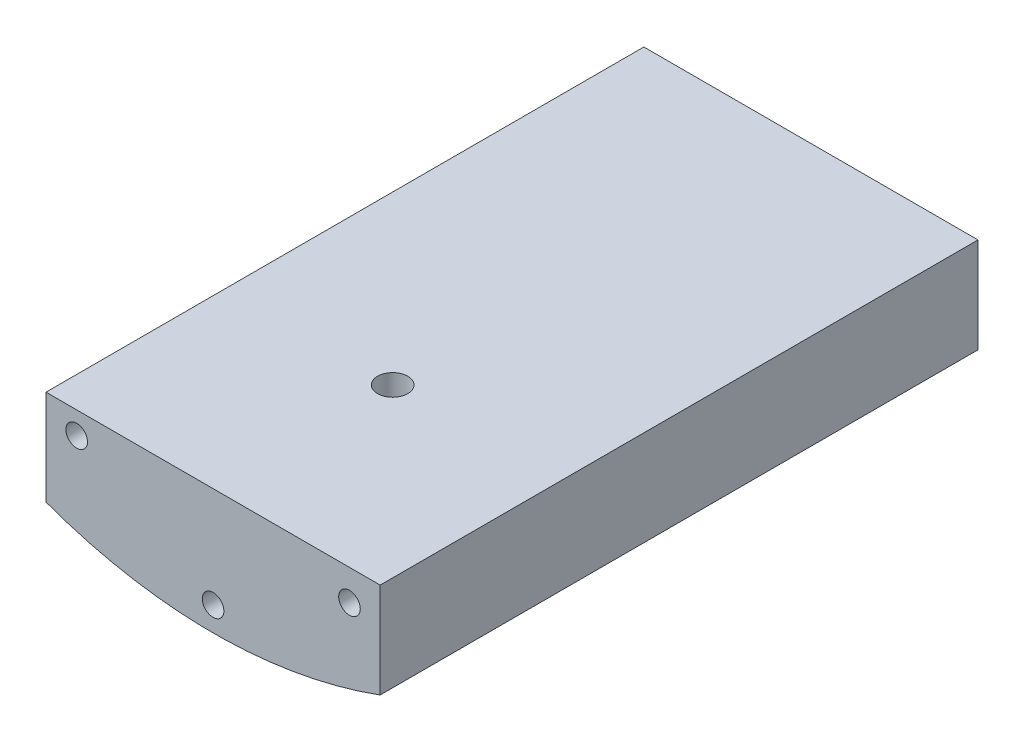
ISO-10303-21;
HEADER;
FILE_DESCRIPTION(('STEP AP214'),'2;1');
FILE_NAME('part.step','',(''),(''),'','','');
FILE_SCHEMA(('AUTOMOTIVE_DESIGN { 1 0 10303 214 1 1 1 1 }'));
ENDSEC;
DATA;
#1=APPLICATION_CONTEXT('core data for automotive mechanical design processes');
#2=APPLICATION_PROTOCOL_DEFINITION('international standard','automotive_design',2000,#1);
#3=PRODUCT_CONTEXT('',#1,'mechanical');
#4=PRODUCT('Part','Part','',(#3));
#5=PRODUCT_RELATED_PRODUCT_CATEGORY('part','',(#4));
#6=PRODUCT_DEFINITION_FORMATION('','',#4);
#7=PRODUCT_DEFINITION_CONTEXT('part definition',#1,'design');
#8=PRODUCT_DEFINITION('design','',#6,#7);
#9=PRODUCT_DEFINITION_SHAPE('','',#8);
#10=(LENGTH_UNIT() NAMED_UNIT(*) SI_UNIT(.MILLI.,.METRE.));
#11=(NAMED_UNIT(*) PLANE_ANGLE_UNIT() SI_UNIT($,.RADIAN.));
#12=(NAMED_UNIT(*) SI_UNIT($,.STERADIAN.) SOLID_ANGLE_UNIT());
#13=UNCERTAINTY_MEASURE_WITH_UNIT(LENGTH_MEASURE(1.E-05),#10,'distance_accuracy_value','');
#14=(GEOMETRIC_REPRESENTATION_CONTEXT(3) GLOBAL_UNCERTAINTY_ASSIGNED_CONTEXT((#13)) GLOBAL_UNIT_ASSIGNED_CONTEXT((#10,
#11,#12)) REPRESENTATION_CONTEXT('',''));
#15=CARTESIAN_POINT('',(0.,0.,0.));
#16=DIRECTION('',(0.,0.,1.));
#17=DIRECTION('',(1.,0.,0.));
#18=AXIS2_PLACEMENT_3D('',#15,#16,#17);
#19=CARTESIAN_POINT('',(3.3782,-23.495,93.472));
#20=DIRECTION('',(0.,1.,0.));
#21=DIRECTION('',(0.,0.,1.));
#22=AXIS2_PLACEMENT_3D('',#19,#20,#21);
#23=PLANE('',#22);
#24=CARTESIAN_POINT('',(0.,-23.495,93.472));
#25=DIRECTION('',(0.,-1.,0.));
#26=DIRECTION('',(0.,0.,-1.));
#27=AXIS2_PLACEMENT_3D('',#24,#25,#26);
#28=CIRCLE('',#27,6.74624);
#29=CARTESIAN_POINT('',(-2.20029103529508,-23.495,99.8493406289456));
#30=VERTEX_POINT('',#29);
#31=CARTESIAN_POINT('',(-2.20029103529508,-23.495,87.0946593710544));
#32=VERTEX_POINT('',#31);
#33=EDGE_CURVE('E138',#30,#32,#28,.T.);
#34=ORIENTED_EDGE('',*,*,#33,.T.);
#35=DIRECTION('',(0.,0.,1.));
#36=VECTOR('',#35,1.);
#37=CARTESIAN_POINT('',(-2.20029103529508,-23.495,133.604));
#38=LINE('',#37,#36);
#39=CARTESIAN_POINT('',(-2.20029103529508,-23.495,90.9086126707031));
#40=VERTEX_POINT('',#39);
#41=EDGE_CURVE('E124',#32,#40,#38,.T.);
#42=ORIENTED_EDGE('',*,*,#41,.T.);
#43=CARTESIAN_POINT('',(0.,-23.495,93.472));
#44=DIRECTION('',(0.,-1.,0.));
#45=DIRECTION('',(0.,0.,-1.));
#46=AXIS2_PLACEMENT_3D('',#43,#44,#45);
#47=CIRCLE('',#46,3.3782);
#48=CARTESIAN_POINT('',(-2.20029103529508,-23.495,96.0353873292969));
#49=VERTEX_POINT('',#48);
#50=EDGE_CURVE('E136',#49,#40,#47,.T.);
#51=ORIENTED_EDGE('',*,*,#50,.F.);
#52=EDGE_CURVE('E142',#49,#30,#38,.T.);
#53=ORIENTED_EDGE('',*,*,#52,.T.);
#54=EDGE_LOOP('',(#34,#42,#51,#53));
#55=FACE_BOUND('',#54,.T.);
#56=ADVANCED_FACE('F43',(#55),#23,.F.);
#57=CARTESIAN_POINT('',(0.,80.01,133.604));
#58=DIRECTION('',(0.,0.,-1.));
#59=DIRECTION('',(-1.,0.,0.));
#60=AXIS2_PLACEMENT_3D('',#57,#58,#59);
#61=CYLINDRICAL_SURFACE('',#60,107.95);
#62=CARTESIAN_POINT('',(0.,-27.94,86.72576));
#63=CARTESIAN_POINT('',(-0.189339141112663,-27.9400002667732,86.7257584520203));
#64=CARTESIAN_POINT('',(-0.37865360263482,-27.9395008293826,86.7337341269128));
#65=CARTESIAN_POINT('',(-0.755997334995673,-27.9375176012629,86.7655797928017));
#66=CARTESIAN_POINT('',(-0.944026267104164,-27.9360335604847,86.7894538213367));
#67=CARTESIAN_POINT('',(-1.31755641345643,-27.9321209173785,86.8529575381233));
#68=CARTESIAN_POINT('',(-1.50305532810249,-27.9296915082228,86.8926006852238));
#69=CARTESIAN_POINT('',(-1.87011315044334,-27.9239561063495,86.987374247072));
#70=CARTESIAN_POINT('',(-2.0516705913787,-27.9206497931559,87.0425103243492));
#71=CARTESIAN_POINT('',(-2.40932304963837,-27.9132580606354,87.1678117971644));
#72=CARTESIAN_POINT('',(-2.58542281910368,-27.9091733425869,87.2379636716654));
#73=CARTESIAN_POINT('',(-2.93114710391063,-27.9003368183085,87.392853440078));
#74=CARTESIAN_POINT('',(-3.10076920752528,-27.8955847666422,87.4775967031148));
#75=CARTESIAN_POINT('',(-3.43216973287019,-27.8855521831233,87.660992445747));
#76=CARTESIAN_POINT('',(-3.59395279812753,-27.8802719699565,87.7596365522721));
#77=CARTESIAN_POINT('',(-3.90870066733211,-27.8693278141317,87.9702113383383));
#78=CARTESIAN_POINT('',(-4.06166218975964,-27.8636637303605,88.0821469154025));
#79=CARTESIAN_POINT('',(-4.35776381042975,-27.8521081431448,88.3185954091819));
#80=CARTESIAN_POINT('',(-4.50089442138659,-27.8462164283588,88.4431201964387));
#81=CARTESIAN_POINT('',(-4.77621337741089,-27.834375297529,88.7038247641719));
#82=CARTESIAN_POINT('',(-4.90839766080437,-27.8284258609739,88.8400088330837));
#83=CARTESIAN_POINT('',(-5.16078789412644,-27.8166420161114,89.1229823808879));
#84=CARTESIAN_POINT('',(-5.28099774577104,-27.8108075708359,89.2697683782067));
#85=CARTESIAN_POINT('',(-5.50867853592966,-27.7994149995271,89.5730031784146));
#86=CARTESIAN_POINT('',(-5.61614475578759,-27.7938569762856,89.729455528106));
#87=CARTESIAN_POINT('',(-5.81756729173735,-27.7831750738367,90.0509388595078));
#88=CARTESIAN_POINT('',(-5.91151765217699,-27.7780513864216,90.2159735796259));
#89=CARTESIAN_POINT('',(-6.08521408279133,-27.7683848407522,90.5534459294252));
#90=CARTESIAN_POINT('',(-6.16495488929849,-27.7638421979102,90.7258862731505));
#91=CARTESIAN_POINT('',(-6.30959162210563,-27.7554713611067,91.0768389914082));
#92=CARTESIAN_POINT('',(-6.37449314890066,-27.7516428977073,91.2553490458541));
#93=CARTESIAN_POINT('',(-6.48904322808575,-27.7448052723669,91.6172324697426));
#94=CARTESIAN_POINT('',(-6.53868614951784,-27.7417964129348,91.8006076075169));
#95=CARTESIAN_POINT('',(-6.66396073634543,-27.7341484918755,92.3554619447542));
#96=CARTESIAN_POINT('',(-6.71628797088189,-27.7308671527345,92.7325210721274));
#97=CARTESIAN_POINT('',(-6.75688206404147,-27.7283283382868,93.489879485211));
#98=CARTESIAN_POINT('',(-6.74514964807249,-27.7290708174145,93.8701787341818));
#99=CARTESIAN_POINT('',(-6.65810898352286,-27.7344846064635,94.6229097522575));
#100=CARTESIAN_POINT('',(-6.58289005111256,-27.7391503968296,94.9953518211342));
#101=CARTESIAN_POINT('',(-6.37112787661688,-27.7518781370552,95.7222984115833));
#102=CARTESIAN_POINT('',(-6.23458426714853,-27.7599401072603,96.0768028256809));
#103=CARTESIAN_POINT('',(-5.90395323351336,-27.7785575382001,96.7581159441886));
#104=CARTESIAN_POINT('',(-5.70982528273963,-27.7891147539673,97.0849049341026));
#105=CARTESIAN_POINT('',(-5.2695639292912,-27.8115313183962,97.7012904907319));
#106=CARTESIAN_POINT('',(-5.023429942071,-27.8233906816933,97.9908866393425));
#107=CARTESIAN_POINT('',(-4.48564059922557,-27.8470995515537,98.5251870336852));
#108=CARTESIAN_POINT('',(-4.1939079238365,-27.8589490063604,98.7698134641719));
#109=CARTESIAN_POINT('',(-3.57347337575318,-27.8812831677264,99.206629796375));
#110=CARTESIAN_POINT('',(-3.24477149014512,-27.8917678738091,99.3988196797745));
#111=CARTESIAN_POINT('',(-2.55968200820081,-27.9101918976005,99.7253008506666));
#112=CARTESIAN_POINT('',(-2.20329300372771,-27.9181310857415,99.8595891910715));
#113=CARTESIAN_POINT('',(-1.47296694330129,-27.9305676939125,100.066403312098));
#114=CARTESIAN_POINT('',(-1.0990300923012,-27.9350651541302,100.13892981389));
#115=CARTESIAN_POINT('',(-0.344898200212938,-27.9401063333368,100.22006508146));
#116=CARTESIAN_POINT('',(0.0352852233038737,-27.9406567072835,100.228781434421));
#117=CARTESIAN_POINT('',(0.79171178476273,-27.9377593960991,100.182330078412));
#118=CARTESIAN_POINT('',(1.16795494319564,-27.9343117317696,100.127162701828));
#119=CARTESIAN_POINT('',(1.90551772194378,-27.9238107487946,99.9545989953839));
#120=CARTESIAN_POINT('',(2.26684893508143,-27.9167602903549,99.8372520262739));
#121=CARTESIAN_POINT('',(2.96468874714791,-27.899846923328,99.5437102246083));
#122=CARTESIAN_POINT('',(3.3011971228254,-27.8899839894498,99.3675148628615));
#123=CARTESIAN_POINT('',(3.94033173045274,-27.8685373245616,98.9610043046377));
#124=CARTESIAN_POINT('',(4.24291218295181,-27.8569513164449,98.7306172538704));
#125=CARTESIAN_POINT('',(4.80514079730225,-27.8333700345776,98.2223664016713));
#126=CARTESIAN_POINT('',(5.06478853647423,-27.8213747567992,97.9445021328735));
#127=CARTESIAN_POINT('',(5.53414624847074,-27.7983075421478,97.3487252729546));
#128=CARTESIAN_POINT('',(5.7437864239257,-27.7872369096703,97.0307576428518));
#129=CARTESIAN_POINT('',(6.10669864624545,-27.7672884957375,96.3640578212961));
#130=CARTESIAN_POINT('',(6.25997104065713,-27.7584107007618,96.0153258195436));
#131=CARTESIAN_POINT('',(6.50568345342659,-27.7438574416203,95.2973217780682));
#132=CARTESIAN_POINT('',(6.59816739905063,-27.7381796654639,94.928064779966));
#133=CARTESIAN_POINT('',(6.71979331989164,-27.7306644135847,94.1790207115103));
#134=CARTESIAN_POINT('',(6.74893592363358,-27.7288268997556,93.7992337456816));
#135=CARTESIAN_POINT('',(6.74459331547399,-27.7290956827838,93.2306300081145));
#136=CARTESIAN_POINT('',(6.73514704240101,-27.7296887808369,93.0413351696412));
#137=CARTESIAN_POINT('',(6.70037697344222,-27.7318572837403,92.6642339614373));
#138=CARTESIAN_POINT('',(6.67505905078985,-27.7334323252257,92.4764270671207));
#139=CARTESIAN_POINT('',(6.60870818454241,-27.7375223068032,92.1035626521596));
#140=CARTESIAN_POINT('',(6.56766943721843,-27.7400375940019,91.9185061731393));
#141=CARTESIAN_POINT('',(6.47019352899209,-27.7459347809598,91.552577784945));
#142=CARTESIAN_POINT('',(6.41376203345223,-27.7493163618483,91.3717043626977));
#143=CARTESIAN_POINT('',(6.28587392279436,-27.7568519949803,91.0152940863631));
#144=CARTESIAN_POINT('',(6.21441192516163,-27.7610063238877,90.8397591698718));
#145=CARTESIAN_POINT('',(6.05701436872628,-27.7699669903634,90.4953984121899));
#146=CARTESIAN_POINT('',(5.97108413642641,-27.7747730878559,90.3265701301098));
#147=CARTESIAN_POINT('',(5.78531112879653,-27.7849039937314,89.9966907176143));
#148=CARTESIAN_POINT('',(5.68546363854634,-27.7902289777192,89.8356422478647));
#149=CARTESIAN_POINT('',(5.47262574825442,-27.8012434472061,89.5225777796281));
#150=CARTESIAN_POINT('',(5.35964017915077,-27.806932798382,89.3705584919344));
#151=CARTESIAN_POINT('',(5.12106069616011,-27.8185283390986,89.0762698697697));
#152=CARTESIAN_POINT('',(4.99544241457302,-27.8244349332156,88.9340203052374));
#153=CARTESIAN_POINT('',(4.73272174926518,-27.8362847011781,88.6606568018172));
#154=CARTESIAN_POINT('',(4.59562360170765,-27.8422278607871,88.5295387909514));
#155=CARTESIAN_POINT('',(4.31078497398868,-27.8539882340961,88.2792304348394));
#156=CARTESIAN_POINT('',(4.16303801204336,-27.8598053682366,88.1600474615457));
#157=CARTESIAN_POINT('',(3.85807835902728,-27.8711429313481,87.9345881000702));
#158=CARTESIAN_POINT('',(3.70086917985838,-27.8766634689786,87.8283069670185));
#159=CARTESIAN_POINT('',(3.37778751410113,-27.8872622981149,87.6291950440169));
#160=CARTESIAN_POINT('',(3.21190149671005,-27.892339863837,87.5363861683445));
#161=CARTESIAN_POINT('',(2.87294103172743,-27.9018966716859,87.3651179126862));
#162=CARTESIAN_POINT('',(2.69986923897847,-27.9063761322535,87.2866532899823));
#163=CARTESIAN_POINT('',(2.34785890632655,-27.9146080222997,87.14465486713));
#164=CARTESIAN_POINT('',(2.1689255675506,-27.9183610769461,87.0811082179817));
#165=CARTESIAN_POINT('',(1.80638584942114,-27.9250376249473,86.9693307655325));
#166=CARTESIAN_POINT('',(1.62278067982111,-27.9279613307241,86.9210960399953));
#167=CARTESIAN_POINT('',(1.20159790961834,-27.9335696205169,86.8292478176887));
#168=CARTESIAN_POINT('',(0.962945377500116,-27.9359719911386,86.7904744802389));
#169=CARTESIAN_POINT('',(0.48284852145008,-27.9391870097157,86.7387315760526));
#170=CARTESIAN_POINT('',(0.241404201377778,-27.9399996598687,86.7257619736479));
#171=CARTESIAN_POINT('',(0.,-27.94,86.72576));
#172=B_SPLINE_CURVE_WITH_KNOTS('',3,(#62,#63,#64,#65,#66,#67,#68,#69,#70,#71,#72,#73,#74,#75,
#76,#77,#78,#79,#80,#81,#82,#83,#84,#85,#86,#87,#88,#89,#90,#91,#92,#93,#94,#95,#96,#97,#98,#99,
#100,#101,#102,#103,#104,#105,#106,#107,#108,#109,#110,#111,#112,#113,#114,#115,#116,#117,#118,
#119,#120,#121,#122,#123,#124,#125,#126,#127,#128,#129,#130,#131,#132,#133,#134,#135,#136,#137,
#138,#139,#140,#141,#142,#143,#144,#145,#146,#147,#148,#149,#150,#151,#152,#153,#154,#155,#156,
#157,#158,#159,#160,#161,#162,#163,#164,#165,#166,#167,#168,#169,#170,#171),.UNSPECIFIED.,.T.,
.F.,(4,2,2,2,2,2,2,2,2,2,2,2,2,2,2,2,2,2,2,2,2,2,2,2,2,2,2,2,2,2,2,2,2,2,2,2,2,2,2,2,2,2,2,2,2,
2,2,2,2,2,2,2,2,2,4),(0.,0.56780647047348,1.13575719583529,1.70419370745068,2.27283824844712,
2.84097288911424,3.40931703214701,3.97732028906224,4.54553349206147,5.11428755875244,
5.68325172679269,6.25202989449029,6.82101801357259,7.39025608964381,7.95970459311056,
8.52893782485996,9.09838087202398,10.2345409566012,11.370688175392,12.5052396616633,
13.6397979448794,14.775156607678,15.910528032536,17.0478459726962,18.1851643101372,
19.3225405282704,20.4599034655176,21.5953483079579,22.7307872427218,23.865326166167,
24.9998752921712,26.1359373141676,27.2720105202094,28.4096602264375,29.54730291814,
30.6841226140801,31.8209310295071,32.3889724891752,32.9568038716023,33.5248450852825,
34.0926775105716,34.6607136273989,35.2285410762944,35.79656136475,36.3643734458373,
36.9333026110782,37.5020227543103,38.0710920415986,38.6399514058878,39.2097259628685,
39.779291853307,40.3483653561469,40.9172929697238,41.6412376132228,42.3651812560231),.UNSPECIFIED.);
#173=CARTESIAN_POINT('',(0.,-27.94,86.72576));
#174=VERTEX_POINT('',#173);
#175=EDGE_CURVE('E131',#174,#174,#172,.T.);
#176=ORIENTED_EDGE('',*,*,#175,.T.);
#177=EDGE_LOOP('',(#176));
#178=FACE_BOUND('',#177,.T.);
#179=CARTESIAN_POINT('',(0.,80.01,0.));
#180=DIRECTION('',(0.,0.,1.));
#181=DIRECTION('',(1.,0.,0.));
#182=AXIS2_PLACEMENT_3D('',#179,#180,#181);
#183=CIRCLE('',#182,107.95);
#184=CARTESIAN_POINT('',(-37.338,-21.2770981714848,0.));
#185=VERTEX_POINT('',#184);
#186=CARTESIAN_POINT('',(37.338,-21.2770981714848,0.));
#187=VERTEX_POINT('',#186);
#188=EDGE_CURVE('E159',#185,#187,#183,.T.);
#189=ORIENTED_EDGE('',*,*,#188,.T.);
#190=DIRECTION('',(0.,0.,-1.));
#191=VECTOR('',#190,1.);
#192=CARTESIAN_POINT('',(37.338,-21.2770981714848,133.604));
#193=LINE('',#192,#191);
#194=CARTESIAN_POINT('',(37.338,-21.2770981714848,133.604));
#195=VERTEX_POINT('',#194);
#196=EDGE_CURVE('E195',#195,#187,#193,.T.);
#197=ORIENTED_EDGE('',*,*,#196,.F.);
#198=CARTESIAN_POINT('',(0.,80.01,133.604));
#199=DIRECTION('',(0.,0.,1.));
#200=DIRECTION('',(1.,0.,0.));
#201=AXIS2_PLACEMENT_3D('',#198,#199,#200);
#202=CIRCLE('',#201,107.95);
#203=CARTESIAN_POINT('',(-37.338,-21.2770981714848,133.604));
#204=VERTEX_POINT('',#203);
#205=EDGE_CURVE('E160',#204,#195,#202,.T.);
#206=ORIENTED_EDGE('',*,*,#205,.F.);
#207=DIRECTION('',(0.,0.,-1.));
#208=VECTOR('',#207,1.);
#209=CARTESIAN_POINT('',(-37.338,-21.2770981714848,133.604));
#210=LINE('',#209,#208);
#211=EDGE_CURVE('E173',#204,#185,#210,.T.);
#212=ORIENTED_EDGE('',*,*,#211,.T.);
#213=EDGE_LOOP('',(#189,#197,#206,#212));
#214=FACE_BOUND('',#213,.T.);
#215=ADVANCED_FACE('F45',(#178,#214),#61,.T.);
#216=CARTESIAN_POINT('',(37.338,0.,133.604));
#217=DIRECTION('',(-1.,0.,0.));
#218=DIRECTION('',(0.,0.,1.));
#219=AXIS2_PLACEMENT_3D('',#216,#217,#218);
#220=PLANE('',#219);
#221=DIRECTION('',(0.,1.,0.));
#222=VECTOR('',#221,1.);
#223=CARTESIAN_POINT('',(37.338,0.,0.));
#224=LINE('',#223,#222);
#225=CARTESIAN_POINT('',(37.338,0.,0.));
#226=VERTEX_POINT('',#225);
#227=EDGE_CURVE('E177',#187,#226,#224,.T.);
#228=ORIENTED_EDGE('',*,*,#227,.T.);
#229=DIRECTION('',(0.,0.,-1.));
#230=VECTOR('',#229,1.);
#231=CARTESIAN_POINT('',(37.338,0.,133.604));
#232=LINE('',#231,#230);
#233=CARTESIAN_POINT('',(37.338,0.,133.604));
#234=VERTEX_POINT('',#233);
#235=EDGE_CURVE('E191',#234,#226,#232,.T.);
#236=ORIENTED_EDGE('',*,*,#235,.F.);
#237=DIRECTION('',(0.,1.,0.));
#238=VECTOR('',#237,1.);
#239=CARTESIAN_POINT('',(37.338,0.,133.604));
#240=LINE('',#239,#238);
#241=EDGE_CURVE('E163',#195,#234,#240,.T.);
#242=ORIENTED_EDGE('',*,*,#241,.F.);
#243=ORIENTED_EDGE('',*,*,#196,.T.);
#244=EDGE_LOOP('',(#228,#236,#242,#243));
#245=FACE_BOUND('',#244,.T.);
#246=ADVANCED_FACE('F281',(#245),#220,.F.);
#247=CARTESIAN_POINT('',(-37.338,0.,133.604));
#248=DIRECTION('',(0.,-1.,0.));
#249=DIRECTION('',(0.,0.,-1.));
#250=AXIS2_PLACEMENT_3D('',#247,#248,#249);
#251=PLANE('',#250);
#252=CARTESIAN_POINT('',(0.,0.,93.472));
#253=DIRECTION('',(0.,-1.,0.));
#254=DIRECTION('',(0.,0.,-1.));
#255=AXIS2_PLACEMENT_3D('',#252,#253,#254);
#256=CIRCLE('',#255,3.37819999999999);
#257=CARTESIAN_POINT('',(0.,0.,90.0938));
#258=VERTEX_POINT('',#257);
#259=EDGE_CURVE('E150',#258,#258,#256,.T.);
#260=ORIENTED_EDGE('',*,*,#259,.T.);
#261=EDGE_LOOP('',(#260));
#262=FACE_BOUND('',#261,.T.);
#263=DIRECTION('',(-1.,0.,0.));
#264=VECTOR('',#263,1.);
#265=CARTESIAN_POINT('',(-37.338,0.,0.));
#266=LINE('',#265,#264);
#267=CARTESIAN_POINT('',(-37.338,0.,0.));
#268=VERTEX_POINT('',#267);
#269=EDGE_CURVE('E179',#226,#268,#266,.T.);
#270=ORIENTED_EDGE('',*,*,#269,.T.);
#271=DIRECTION('',(0.,0.,-1.));
#272=VECTOR('',#271,1.);
#273=CARTESIAN_POINT('',(-37.338,0.,133.604));
#274=LINE('',#273,#272);
#275=CARTESIAN_POINT('',(-37.338,0.,133.604));
#276=VERTEX_POINT('',#275);
#277=EDGE_CURVE('E187',#276,#268,#274,.T.);
#278=ORIENTED_EDGE('',*,*,#277,.F.);
#279=DIRECTION('',(-1.,0.,0.));
#280=VECTOR('',#279,1.);
#281=CARTESIAN_POINT('',(-37.338,0.,133.604));
#282=LINE('',#281,#280);
#283=EDGE_CURVE('E167',#234,#276,#282,.T.);
#284=ORIENTED_EDGE('',*,*,#283,.F.);
#285=ORIENTED_EDGE('',*,*,#235,.T.);
#286=EDGE_LOOP('',(#270,#278,#284,#285));
#287=FACE_BOUND('',#286,.T.);
#288=ADVANCED_FACE('F286',(#262,#287),#251,.F.);
#289=CARTESIAN_POINT('',(-37.338,0.,133.604));
#290=DIRECTION('',(1.,0.,0.));
#291=DIRECTION('',(0.,0.,-1.));
#292=AXIS2_PLACEMENT_3D('',#289,#290,#291);
#293=PLANE('',#292);
#294=DIRECTION('',(0.,-1.,0.));
#295=VECTOR('',#294,1.);
#296=CARTESIAN_POINT('',(-37.338,0.,0.));
#297=LINE('',#296,#295);
#298=EDGE_CURVE('E164',#268,#185,#297,.T.);
#299=ORIENTED_EDGE('',*,*,#298,.T.);
#300=ORIENTED_EDGE('',*,*,#211,.F.);
#301=DIRECTION('',(0.,-1.,0.));
#302=VECTOR('',#301,1.);
#303=CARTESIAN_POINT('',(-37.338,0.,133.604));
#304=LINE('',#303,#302);
#305=EDGE_CURVE('E170',#276,#204,#304,.T.);
#306=ORIENTED_EDGE('',*,*,#305,.F.);
#307=ORIENTED_EDGE('',*,*,#277,.T.);
#308=EDGE_LOOP('',(#299,#300,#306,#307));
#309=FACE_BOUND('',#308,.T.);
#310=ADVANCED_FACE('F267',(#309),#293,.F.);
#311=CARTESIAN_POINT('',(0.,80.01,133.604));
#312=DIRECTION('',(0.,0.,1.));
#313=DIRECTION('',(1.,0.,0.));
#314=AXIS2_PLACEMENT_3D('',#311,#312,#313);
#315=PLANE('',#314);
#316=CARTESIAN_POINT('',(30.48,-6.858,133.604));
#317=DIRECTION('',(0.,0.,1.));
#318=DIRECTION('',(1.,0.,0.));
#319=AXIS2_PLACEMENT_3D('',#316,#317,#318);
#320=CIRCLE('',#319,2.41299999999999);
#321=CARTESIAN_POINT('',(32.893,-6.858,133.604));
#322=VERTEX_POINT('',#321);
#323=EDGE_CURVE('E257',#322,#322,#320,.T.);
#324=ORIENTED_EDGE('',*,*,#323,.F.);
#325=EDGE_LOOP('',(#324));
#326=FACE_BOUND('',#325,.T.);
#327=CARTESIAN_POINT('',(-30.48,-5.00039155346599,133.604));
#328=DIRECTION('',(0.,0.,1.));
#329=DIRECTION('',(1.,0.,0.));
#330=AXIS2_PLACEMENT_3D('',#327,#328,#329);
#331=CIRCLE('',#330,2.41299999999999);
#332=CARTESIAN_POINT('',(-28.067,-5.00039155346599,133.604));
#333=VERTEX_POINT('',#332);
#334=EDGE_CURVE('E250',#333,#333,#331,.T.);
#335=ORIENTED_EDGE('',*,*,#334,.F.);
#336=EDGE_LOOP('',(#335));
#337=FACE_BOUND('',#336,.T.);
#338=CARTESIAN_POINT('',(0.,-22.5044,133.604));
#339=DIRECTION('',(0.,0.,1.));
#340=DIRECTION('',(1.,0.,0.));
#341=AXIS2_PLACEMENT_3D('',#338,#339,#340);
#342=CIRCLE('',#341,2.41299999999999);
#343=CARTESIAN_POINT('',(2.41299999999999,-22.5044,133.604));
#344=VERTEX_POINT('',#343);
#345=EDGE_CURVE('E240',#344,#344,#342,.T.);
#346=ORIENTED_EDGE('',*,*,#345,.F.);
#347=EDGE_LOOP('',(#346));
#348=FACE_BOUND('',#347,.T.);
#349=ORIENTED_EDGE('',*,*,#205,.T.);
#350=ORIENTED_EDGE('',*,*,#241,.T.);
#351=ORIENTED_EDGE('',*,*,#283,.T.);
#352=ORIENTED_EDGE('',*,*,#305,.T.);
#353=EDGE_LOOP('',(#349,#350,#351,#352));
#354=FACE_BOUND('',#353,.T.);
#355=ADVANCED_FACE('F264',(#326,#337,#348,#354),#315,.T.);
#356=CARTESIAN_POINT('',(0.,80.01,0.));
#357=DIRECTION('',(0.,0.,1.));
#358=DIRECTION('',(1.,0.,0.));
#359=AXIS2_PLACEMENT_3D('',#356,#357,#358);
#360=PLANE('',#359);
#361=CARTESIAN_POINT('',(30.48,-6.858,0.));
#362=DIRECTION('',(0.,0.,1.));
#363=DIRECTION('',(1.,0.,0.));
#364=AXIS2_PLACEMENT_3D('',#361,#362,#363);
#365=CIRCLE('',#364,2.41299999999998);
#366=CARTESIAN_POINT('',(32.893,-6.858,0.));
#367=VERTEX_POINT('',#366);
#368=EDGE_CURVE('E254',#367,#367,#365,.T.);
#369=ORIENTED_EDGE('',*,*,#368,.T.);
#370=EDGE_LOOP('',(#369));
#371=FACE_BOUND('',#370,.T.);
#372=CARTESIAN_POINT('',(-30.48,-5.00039155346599,0.));
#373=DIRECTION('',(0.,0.,1.));
#374=DIRECTION('',(1.,0.,0.));
#375=AXIS2_PLACEMENT_3D('',#372,#373,#374);
#376=CIRCLE('',#375,2.41299999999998);
#377=CARTESIAN_POINT('',(-28.067,-5.00039155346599,0.));
#378=VERTEX_POINT('',#377);
#379=EDGE_CURVE('E244',#378,#378,#376,.T.);
#380=ORIENTED_EDGE('',*,*,#379,.T.);
#381=EDGE_LOOP('',(#380));
#382=FACE_BOUND('',#381,.T.);
#383=CARTESIAN_POINT('',(0.,-22.5044,0.));
#384=DIRECTION('',(0.,0.,1.));
#385=DIRECTION('',(1.,0.,0.));
#386=AXIS2_PLACEMENT_3D('',#383,#384,#385);
#387=CIRCLE('',#386,2.41299999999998);
#388=CARTESIAN_POINT('',(2.41299999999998,-22.5044,0.));
#389=VERTEX_POINT('',#388);
#390=EDGE_CURVE('E238',#389,#389,#387,.T.);
#391=ORIENTED_EDGE('',*,*,#390,.T.);
#392=EDGE_LOOP('',(#391));
#393=FACE_BOUND('',#392,.T.);
#394=ORIENTED_EDGE('',*,*,#188,.F.);
#395=ORIENTED_EDGE('',*,*,#298,.F.);
#396=ORIENTED_EDGE('',*,*,#269,.F.);
#397=ORIENTED_EDGE('',*,*,#227,.F.);
#398=EDGE_LOOP('',(#394,#395,#396,#397));
#399=FACE_BOUND('',#398,.T.);
#400=ADVANCED_FACE('F211',(#371,#382,#393,#399),#360,.F.);
#401=CARTESIAN_POINT('',(0.,-27.94,93.472));
#402=DIRECTION('',(0.,-1.,0.));
#403=DIRECTION('',(0.,0.,-1.));
#404=AXIS2_PLACEMENT_3D('',#401,#402,#403);
#405=CYLINDRICAL_SURFACE('',#404,6.74624);
#406=CARTESIAN_POINT('',(2.20029103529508,-23.495,87.0946593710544));
#407=VERTEX_POINT('',#406);
#408=CARTESIAN_POINT('',(2.20029103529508,-23.495,99.8493406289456));
#409=VERTEX_POINT('',#408);
#410=EDGE_CURVE('E146',#407,#409,#28,.T.);
#411=ORIENTED_EDGE('',*,*,#410,.F.);
#412=CARTESIAN_POINT('',(2.20029103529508,-23.495,87.0946593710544));
#413=CARTESIAN_POINT('',(2.1720084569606,-23.5578163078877,87.084904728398));
#414=CARTESIAN_POINT('',(2.14109576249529,-23.6192934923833,87.0744465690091));
#415=CARTESIAN_POINT('',(2.07424226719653,-23.7392301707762,87.0524577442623));
#416=CARTESIAN_POINT('',(2.03830270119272,-23.7976904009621,87.0409273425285));
#417=CARTESIAN_POINT('',(1.92335042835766,-23.9679613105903,87.0052468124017));
#418=CARTESIAN_POINT('',(1.83714305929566,-24.0747971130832,86.9799852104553));
#419=CARTESIAN_POINT('',(1.64799795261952,-24.2722761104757,86.9294143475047));
#420=CARTESIAN_POINT('',(1.54506453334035,-24.362923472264,86.904105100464));
#421=CARTESIAN_POINT('',(1.32492468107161,-24.5257525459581,86.8561860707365));
#422=CARTESIAN_POINT('',(1.20772086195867,-24.5979376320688,86.8335757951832));
#423=CARTESIAN_POINT('',(0.962066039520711,-24.7215816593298,86.7935536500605));
#424=CARTESIAN_POINT('',(0.833620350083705,-24.773050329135,86.7761393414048));
#425=CARTESIAN_POINT('',(0.569108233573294,-24.8533928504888,86.7484952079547));
#426=CARTESIAN_POINT('',(0.433044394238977,-24.8822743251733,86.7382629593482));
#427=CARTESIAN_POINT('',(0.164827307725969,-24.9153540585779,86.7265079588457));
#428=CARTESIAN_POINT('',(0.0328414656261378,-24.9207637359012,86.7245578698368));
#429=CARTESIAN_POINT('',(-0.230116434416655,-24.9100025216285,86.7284043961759));
#430=CARTESIAN_POINT('',(-0.361088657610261,-24.8938352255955,86.734199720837));
#431=CARTESIAN_POINT('',(-0.614683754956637,-24.841290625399,86.7526499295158));
#432=CARTESIAN_POINT('',(-0.737436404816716,-24.805467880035,86.7651163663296));
#433=CARTESIAN_POINT('',(-0.975174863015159,-24.7152317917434,86.7955365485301));
#434=CARTESIAN_POINT('',(-1.09015917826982,-24.6608148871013,86.8134913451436));
#435=CARTESIAN_POINT('',(-1.3135727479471,-24.5327633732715,86.8538710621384));
#436=CARTESIAN_POINT('',(-1.42162606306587,-24.4585168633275,86.8764316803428));
#437=CARTESIAN_POINT('',(-1.62410242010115,-24.293786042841,86.9233469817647));
#438=CARTESIAN_POINT('',(-1.7185242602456,-24.2033003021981,86.9477018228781));
#439=CARTESIAN_POINT('',(-1.88562604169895,-24.0149326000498,86.9941002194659));
#440=CARTESIAN_POINT('',(-1.95935667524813,-23.9179918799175,87.0161872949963));
#441=CARTESIAN_POINT('',(-2.09160891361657,-23.7137747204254,87.0578206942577));
#442=CARTESIAN_POINT('',(-2.15013230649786,-23.6064994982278,87.077367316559));
#443=CARTESIAN_POINT('',(-2.20029103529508,-23.495,87.0946593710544));
#444=B_SPLINE_CURVE_WITH_KNOTS('',3,(#412,#413,#414,#415,#416,#417,#418,#419,#420,#421,#422,
#423,#424,#425,#426,#427,#428,#429,#430,#431,#432,#433,#434,#435,#436,#437,#438,#439,#440,#441,
#442,#443),.UNSPECIFIED.,.F.,.F.,(4,2,2,2,2,2,2,2,2,2,2,2,2,2,2,4),(0.,0.208587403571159,
0.41712365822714,0.833752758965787,1.25027446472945,1.66671999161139,2.08296972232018,
2.49907890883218,2.89343546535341,3.28772631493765,3.671425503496,4.05519823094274,
4.45255119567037,4.8499391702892,5.21990538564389,5.58982808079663),.UNSPECIFIED.);
#445=EDGE_CURVE('E140',#407,#32,#444,.T.);
#446=ORIENTED_EDGE('',*,*,#445,.T.);
#447=ORIENTED_EDGE('',*,*,#33,.F.);
#448=CARTESIAN_POINT('',(-2.20029103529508,-23.495,99.8493406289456));
#449=CARTESIAN_POINT('',(-2.1720084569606,-23.5578163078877,99.859095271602));
#450=CARTESIAN_POINT('',(-2.14109576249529,-23.6192934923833,99.8695534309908));
#451=CARTESIAN_POINT('',(-2.07424226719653,-23.7392301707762,99.8915422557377));
#452=CARTESIAN_POINT('',(-2.03830270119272,-23.7976904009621,99.9030726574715));
#453=CARTESIAN_POINT('',(-1.92335042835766,-23.9679613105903,99.9387531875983));
#454=CARTESIAN_POINT('',(-1.83714305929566,-24.0747971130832,99.9640147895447));
#455=CARTESIAN_POINT('',(-1.64799795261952,-24.2722761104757,100.014585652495));
#456=CARTESIAN_POINT('',(-1.54506453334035,-24.362923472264,100.039894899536));
#457=CARTESIAN_POINT('',(-1.32492468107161,-24.5257525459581,100.087813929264));
#458=CARTESIAN_POINT('',(-1.20772086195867,-24.5979376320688,100.110424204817));
#459=CARTESIAN_POINT('',(-0.962066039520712,-24.7215816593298,100.150446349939));
#460=CARTESIAN_POINT('',(-0.833620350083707,-24.773050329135,100.167860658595));
#461=CARTESIAN_POINT('',(-0.569108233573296,-24.8533928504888,100.195504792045));
#462=CARTESIAN_POINT('',(-0.433044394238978,-24.8822743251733,100.205737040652));
#463=CARTESIAN_POINT('',(-0.164827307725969,-24.9153540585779,100.217492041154));
#464=CARTESIAN_POINT('',(-0.0328414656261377,-24.9207637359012,100.219442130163));
#465=CARTESIAN_POINT('',(0.230116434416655,-24.9100025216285,100.215595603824));
#466=CARTESIAN_POINT('',(0.361088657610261,-24.8938352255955,100.209800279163));
#467=CARTESIAN_POINT('',(0.614683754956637,-24.841290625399,100.191350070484));
#468=CARTESIAN_POINT('',(0.737436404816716,-24.805467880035,100.17888363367));
#469=CARTESIAN_POINT('',(0.975174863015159,-24.7152317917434,100.14846345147));
#470=CARTESIAN_POINT('',(1.09015917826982,-24.6608148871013,100.130508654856));
#471=CARTESIAN_POINT('',(1.3135727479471,-24.5327633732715,100.090128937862));
#472=CARTESIAN_POINT('',(1.42162606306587,-24.4585168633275,100.067568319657));
#473=CARTESIAN_POINT('',(1.62410242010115,-24.293786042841,100.020653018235));
#474=CARTESIAN_POINT('',(1.7185242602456,-24.2033003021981,99.9962981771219));
#475=CARTESIAN_POINT('',(1.88562604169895,-24.0149326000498,99.9498997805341));
#476=CARTESIAN_POINT('',(1.95935667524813,-23.9179918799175,99.9278127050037));
#477=CARTESIAN_POINT('',(2.09160891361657,-23.7137747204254,99.8861793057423));
#478=CARTESIAN_POINT('',(2.15013230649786,-23.6064994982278,99.866632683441));
#479=CARTESIAN_POINT('',(2.20029103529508,-23.495,99.8493406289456));
#480=B_SPLINE_CURVE_WITH_KNOTS('',3,(#448,#449,#450,#451,#452,#453,#454,#455,#456,#457,#458,
#459,#460,#461,#462,#463,#464,#465,#466,#467,#468,#469,#470,#471,#472,#473,#474,#475,#476,#477,
#478,#479),.UNSPECIFIED.,.F.,.F.,(4,2,2,2,2,2,2,2,2,2,2,2,2,2,2,4),(0.,0.208587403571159,
0.41712365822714,0.833752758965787,1.25027446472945,1.66671999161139,2.08296972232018,
2.49907890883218,2.89343546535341,3.28772631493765,3.671425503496,4.05519823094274,
4.45255119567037,4.8499391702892,5.21990538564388,5.58982808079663),.UNSPECIFIED.);
#481=EDGE_CURVE('E226',#30,#409,#480,.T.);
#482=ORIENTED_EDGE('',*,*,#481,.T.);
#483=EDGE_LOOP('',(#411,#446,#447,#482));
#484=FACE_BOUND('',#483,.T.);
#485=ORIENTED_EDGE('',*,*,#175,.F.);
#486=EDGE_LOOP('',(#485));
#487=FACE_BOUND('',#486,.T.);
#488=ADVANCED_FACE('F207',(#484,#487),#405,.F.);
#489=CARTESIAN_POINT('',(0.,-27.94,93.472));
#490=DIRECTION('',(0.,-1.,0.));
#491=DIRECTION('',(0.,0.,-1.));
#492=AXIS2_PLACEMENT_3D('',#489,#490,#491);
#493=CYLINDRICAL_SURFACE('',#492,3.3782);
#494=ORIENTED_EDGE('',*,*,#259,.F.);
#495=EDGE_LOOP('',(#494));
#496=FACE_BOUND('',#495,.T.);
#497=CARTESIAN_POINT('',(2.20029103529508,-23.495,90.9086126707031));
#498=VERTEX_POINT('',#497);
#499=CARTESIAN_POINT('',(2.20029103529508,-23.495,96.0353873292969));
#500=VERTEX_POINT('',#499);
#501=EDGE_CURVE('E145',#498,#500,#47,.T.);
#502=ORIENTED_EDGE('',*,*,#501,.T.);
#503=CARTESIAN_POINT('',(2.20029103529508,-23.495,96.0353873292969));
#504=CARTESIAN_POINT('',(2.24154878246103,-23.4034799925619,95.9999538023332));
#505=CARTESIAN_POINT('',(2.27756996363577,-23.3080763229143,95.967307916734));
#506=CARTESIAN_POINT('',(2.33790907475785,-23.1105566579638,95.9108885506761));
#507=CARTESIAN_POINT('',(2.36215849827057,-23.0084052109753,95.887167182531));
#508=CARTESIAN_POINT('',(2.39735079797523,-22.7987352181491,95.8522486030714));
#509=CARTESIAN_POINT('',(2.40819034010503,-22.6911815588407,95.8411487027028));
#510=CARTESIAN_POINT('',(2.41522678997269,-22.4754900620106,95.8339809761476));
#511=CARTESIAN_POINT('',(2.41148076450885,-22.3673561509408,95.8378545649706));
#512=CARTESIAN_POINT('',(2.39096577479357,-22.1651053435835,95.8585614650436));
#513=CARTESIAN_POINT('',(2.37558042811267,-22.0706933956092,95.8740163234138));
#514=CARTESIAN_POINT('',(2.33435266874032,-21.886057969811,95.9141008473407));
#515=CARTESIAN_POINT('',(2.30848484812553,-21.795845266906,95.9387527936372));
#516=CARTESIAN_POINT('',(2.23311633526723,-21.5801659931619,96.0075616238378));
#517=CARTESIAN_POINT('',(2.17821941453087,-21.4577874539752,96.0554597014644));
#518=CARTESIAN_POINT('',(2.05064914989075,-21.2257283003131,96.1578487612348));
#519=CARTESIAN_POINT('',(1.97794686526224,-21.1160687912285,96.2123504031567));
#520=CARTESIAN_POINT('',(1.81411737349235,-20.9076794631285,96.3235362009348));
#521=CARTESIAN_POINT('',(1.72258958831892,-20.8092753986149,96.3802413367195));
#522=CARTESIAN_POINT('',(1.52317027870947,-20.6280656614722,96.4894640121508));
#523=CARTESIAN_POINT('',(1.41529817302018,-20.5452417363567,96.5419864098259));
#524=CARTESIAN_POINT('',(1.19937548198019,-20.4071953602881,96.6319965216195));
#525=CARTESIAN_POINT('',(1.09317891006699,-20.3497827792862,96.6705514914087));
#526=CARTESIAN_POINT('',(0.870797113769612,-20.250721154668,96.7381015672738));
#527=CARTESIAN_POINT('',(0.754617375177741,-20.2090635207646,96.7671018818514));
#528=CARTESIAN_POINT('',(0.514122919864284,-20.1434960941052,96.8131048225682));
#529=CARTESIAN_POINT('',(0.389758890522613,-20.1197071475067,96.830025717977));
#530=CARTESIAN_POINT('',(0.137745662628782,-20.092008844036,96.8497504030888));
#531=CARTESIAN_POINT('',(0.0100985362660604,-20.0880872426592,96.8525628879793));
#532=CARTESIAN_POINT('',(-0.229182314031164,-20.0996672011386,96.8442989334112));
#533=CARTESIAN_POINT('',(-0.340984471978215,-20.1130080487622,96.8347674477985));
#534=CARTESIAN_POINT('',(-0.560303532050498,-20.1546996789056,96.8052478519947));
#535=CARTESIAN_POINT('',(-0.667819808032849,-20.1830526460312,96.7852582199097));
#536=CARTESIAN_POINT('',(-0.877703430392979,-20.2539165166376,96.7359982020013));
#537=CARTESIAN_POINT('',(-0.97996549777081,-20.29663949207,96.70658913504));
#538=CARTESIAN_POINT('',(-1.17585090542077,-20.3944375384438,96.6406441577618));
#539=CARTESIAN_POINT('',(-1.26947263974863,-20.4495148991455,96.6041069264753));
#540=CARTESIAN_POINT('',(-1.46047123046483,-20.5795935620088,96.5202294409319));
#541=CARTESIAN_POINT('',(-1.55630232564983,-20.6563445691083,96.4720908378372));
#542=CARTESIAN_POINT('',(-1.73459723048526,-20.8225466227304,96.3726651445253));
#543=CARTESIAN_POINT('',(-1.81703674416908,-20.9120202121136,96.3213725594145));
#544=CARTESIAN_POINT('',(-1.98102542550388,-21.1192866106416,96.2104632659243));
#545=CARTESIAN_POINT('',(-2.05987744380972,-21.2392934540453,96.1509660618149));
#546=CARTESIAN_POINT('',(-2.19621426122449,-21.4944329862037,96.0403784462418));
#547=CARTESIAN_POINT('',(-2.25373950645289,-21.6295364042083,95.9892722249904));
#548=CARTESIAN_POINT('',(-2.32887042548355,-21.8651622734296,95.9195072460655));
#549=CARTESIAN_POINT('',(-2.35339694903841,-21.9619411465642,95.895719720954));
#550=CARTESIAN_POINT('',(-2.3903493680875,-22.1596457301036,95.8592897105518));
#551=CARTESIAN_POINT('',(-2.40281103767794,-22.2605582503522,95.846614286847));
#552=CARTESIAN_POINT('',(-2.4148351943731,-22.464409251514,95.8343917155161));
#553=CARTESIAN_POINT('',(-2.41434316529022,-22.5673544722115,95.8349000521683));
#554=CARTESIAN_POINT('',(-2.40033880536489,-22.7717692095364,95.8491187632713));
#555=CARTESIAN_POINT('',(-2.38677825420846,-22.8732318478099,95.8628780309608));
#556=CARTESIAN_POINT('',(-2.34899183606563,-23.0644409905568,95.8999837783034));
#557=CARTESIAN_POINT('',(-2.32558993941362,-23.1545082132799,95.9225816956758));
#558=CARTESIAN_POINT('',(-2.269565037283,-23.3290212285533,95.9745478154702));
#559=CARTESIAN_POINT('',(-2.23700357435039,-23.4135000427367,96.0038705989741));
#560=CARTESIAN_POINT('',(-2.20029103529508,-23.495,96.0353873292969));
#561=B_SPLINE_CURVE_WITH_KNOTS('',3,(#503,#504,#505,#506,#507,#508,#509,#510,#511,#512,#513,
#514,#515,#516,#517,#518,#519,#520,#521,#522,#523,#524,#525,#526,#527,#528,#529,#530,#531,#532,
#533,#534,#535,#536,#537,#538,#539,#540,#541,#542,#543,#544,#545,#546,#547,#548,#549,#550,#551,
#552,#553,#554,#555,#556,#557,#558,#559,#560),.UNSPECIFIED.,.F.,.F.,(4,2,2,2,2,2,2,2,2,2,2,2,2,
2,2,2,2,2,2,2,2,2,2,2,2,2,2,2,4),(0.,0.319743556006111,0.641326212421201,0.965371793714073,
1.28815080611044,1.57762477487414,1.86780462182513,2.29276785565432,2.71842646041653,
3.15430818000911,3.58967603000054,3.96832629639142,4.34676980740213,4.72775024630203,
5.10849585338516,5.44588912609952,5.78333151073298,6.12598991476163,6.46871187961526,
6.86287790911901,7.25775126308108,7.72194786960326,8.18525957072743,8.49199486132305,
8.79781782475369,9.10492806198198,9.41317583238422,9.69957781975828,9.98409965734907),.UNSPECIFIED.);
#562=EDGE_CURVE('E12',#500,#49,#561,.T.);
#563=ORIENTED_EDGE('',*,*,#562,.T.);
#564=ORIENTED_EDGE('',*,*,#50,.T.);
#565=CARTESIAN_POINT('',(-2.20029103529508,-23.495,90.9086126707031));
#566=CARTESIAN_POINT('',(-2.24154878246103,-23.4034799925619,90.9440461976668));
#567=CARTESIAN_POINT('',(-2.27756996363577,-23.3080763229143,90.976692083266));
#568=CARTESIAN_POINT('',(-2.33790907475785,-23.1105566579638,91.0331114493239));
#569=CARTESIAN_POINT('',(-2.36215849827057,-23.0084052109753,91.056832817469));
#570=CARTESIAN_POINT('',(-2.39735079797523,-22.7987352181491,91.0917513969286));
#571=CARTESIAN_POINT('',(-2.40819034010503,-22.6911815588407,91.1028512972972));
#572=CARTESIAN_POINT('',(-2.41522678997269,-22.4754900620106,91.1100190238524));
#573=CARTESIAN_POINT('',(-2.41148076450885,-22.3673561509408,91.1061454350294));
#574=CARTESIAN_POINT('',(-2.39096577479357,-22.1651053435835,91.0854385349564));
#575=CARTESIAN_POINT('',(-2.37558042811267,-22.0706933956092,91.0699836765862));
#576=CARTESIAN_POINT('',(-2.33435266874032,-21.886057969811,91.0298991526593));
#577=CARTESIAN_POINT('',(-2.30848484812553,-21.795845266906,91.0052472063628));
#578=CARTESIAN_POINT('',(-2.23311633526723,-21.5801659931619,90.9364383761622));
#579=CARTESIAN_POINT('',(-2.17821941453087,-21.4577874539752,90.8885402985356));
#580=CARTESIAN_POINT('',(-2.05064914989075,-21.2257283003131,90.7861512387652));
#581=CARTESIAN_POINT('',(-1.97794686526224,-21.1160687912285,90.7316495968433));
#582=CARTESIAN_POINT('',(-1.81411737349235,-20.9076794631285,90.6204637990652));
#583=CARTESIAN_POINT('',(-1.72258958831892,-20.8092753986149,90.5637586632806));
#584=CARTESIAN_POINT('',(-1.52317027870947,-20.6280656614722,90.4545359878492));
#585=CARTESIAN_POINT('',(-1.41529817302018,-20.5452417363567,90.4020135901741));
#586=CARTESIAN_POINT('',(-1.19937548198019,-20.4071953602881,90.3120034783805));
#587=CARTESIAN_POINT('',(-1.09317891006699,-20.3497827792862,90.2734485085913));
#588=CARTESIAN_POINT('',(-0.870797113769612,-20.250721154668,90.2058984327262));
#589=CARTESIAN_POINT('',(-0.754617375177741,-20.2090635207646,90.1768981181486));
#590=CARTESIAN_POINT('',(-0.514122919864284,-20.1434960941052,90.1308951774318));
#591=CARTESIAN_POINT('',(-0.389758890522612,-20.1197071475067,90.113974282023));
#592=CARTESIAN_POINT('',(-0.137745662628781,-20.092008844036,90.0942495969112));
#593=CARTESIAN_POINT('',(-0.01009853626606,-20.0880872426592,90.0914371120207));
#594=CARTESIAN_POINT('',(0.229182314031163,-20.0996672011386,90.0997010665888));
#595=CARTESIAN_POINT('',(0.340984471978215,-20.1130080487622,90.1092325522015));
#596=CARTESIAN_POINT('',(0.560303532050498,-20.1546996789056,90.1387521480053));
#597=CARTESIAN_POINT('',(0.667819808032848,-20.1830526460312,90.1587417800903));
#598=CARTESIAN_POINT('',(0.877703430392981,-20.2539165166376,90.2080017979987));
#599=CARTESIAN_POINT('',(0.979965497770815,-20.29663949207,90.23741086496));
#600=CARTESIAN_POINT('',(1.17585090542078,-20.3944375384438,90.3033558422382));
#601=CARTESIAN_POINT('',(1.26947263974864,-20.4495148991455,90.3398930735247));
#602=CARTESIAN_POINT('',(1.46047123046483,-20.5795935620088,90.4237705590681));
#603=CARTESIAN_POINT('',(1.55630232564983,-20.6563445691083,90.4719091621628));
#604=CARTESIAN_POINT('',(1.73459723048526,-20.8225466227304,90.5713348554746));
#605=CARTESIAN_POINT('',(1.81703674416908,-20.9120202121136,90.6226274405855));
#606=CARTESIAN_POINT('',(1.98102542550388,-21.1192866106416,90.7335367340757));
#607=CARTESIAN_POINT('',(2.05987744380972,-21.2392934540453,90.7930339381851));
#608=CARTESIAN_POINT('',(2.19621426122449,-21.4944329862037,90.9036215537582));
#609=CARTESIAN_POINT('',(2.25373950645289,-21.6295364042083,90.9547277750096));
#610=CARTESIAN_POINT('',(2.32887042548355,-21.8651622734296,91.0244927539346));
#611=CARTESIAN_POINT('',(2.35339694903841,-21.9619411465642,91.048280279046));
#612=CARTESIAN_POINT('',(2.3903493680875,-22.1596457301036,91.0847102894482));
#613=CARTESIAN_POINT('',(2.40281103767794,-22.2605582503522,91.097385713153));
#614=CARTESIAN_POINT('',(2.4148351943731,-22.464409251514,91.1096082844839));
#615=CARTESIAN_POINT('',(2.41434316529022,-22.5673544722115,91.1090999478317));
#616=CARTESIAN_POINT('',(2.40033880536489,-22.7717692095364,91.0948812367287));
#617=CARTESIAN_POINT('',(2.38677825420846,-22.8732318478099,91.0811219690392));
#618=CARTESIAN_POINT('',(2.34899183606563,-23.0644409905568,91.0440162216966));
#619=CARTESIAN_POINT('',(2.32558993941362,-23.1545082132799,91.0214183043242));
#620=CARTESIAN_POINT('',(2.269565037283,-23.3290212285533,90.9694521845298));
#621=CARTESIAN_POINT('',(2.23700357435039,-23.4135000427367,90.9401294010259));
#622=CARTESIAN_POINT('',(2.20029103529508,-23.495,90.9086126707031));
#623=B_SPLINE_CURVE_WITH_KNOTS('',3,(#565,#566,#567,#568,#569,#570,#571,#572,#573,#574,#575,
#576,#577,#578,#579,#580,#581,#582,#583,#584,#585,#586,#587,#588,#589,#590,#591,#592,#593,#594,
#595,#596,#597,#598,#599,#600,#601,#602,#603,#604,#605,#606,#607,#608,#609,#610,#611,#612,#613,
#614,#615,#616,#617,#618,#619,#620,#621,#622),.UNSPECIFIED.,.F.,.F.,(4,2,2,2,2,2,2,2,2,2,2,2,2,
2,2,2,2,2,2,2,2,2,2,2,2,2,2,2,4),(0.,0.319743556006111,0.641326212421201,0.965371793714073,
1.28815080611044,1.57762477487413,1.86780462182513,2.29276785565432,2.71842646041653,
3.15430818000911,3.58967603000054,3.96832629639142,4.34676980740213,4.72775024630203,
5.10849585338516,5.44588912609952,5.78333151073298,6.12598991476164,6.46871187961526,
6.86287790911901,7.25775126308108,7.72194786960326,8.18525957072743,8.49199486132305,
8.79781782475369,9.10492806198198,9.41317583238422,9.69957781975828,9.98409965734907),.UNSPECIFIED.);
#624=EDGE_CURVE('E58',#40,#498,#623,.T.);
#625=ORIENTED_EDGE('',*,*,#624,.T.);
#626=EDGE_LOOP('',(#502,#563,#564,#625));
#627=FACE_BOUND('',#626,.T.);
#628=ADVANCED_FACE('F143',(#496,#627),#493,.F.);
#629=ORIENTED_EDGE('',*,*,#410,.T.);
#630=DIRECTION('',(0.,0.,1.));
#631=VECTOR('',#630,1.);
#632=CARTESIAN_POINT('',(2.20029103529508,-23.495,133.604));
#633=LINE('',#632,#631);
#634=EDGE_CURVE('E224',#409,#500,#633,.F.);
#635=ORIENTED_EDGE('',*,*,#634,.T.);
#636=ORIENTED_EDGE('',*,*,#501,.F.);
#637=EDGE_CURVE('E77',#498,#407,#633,.F.);
#638=ORIENTED_EDGE('',*,*,#637,.T.);
#639=EDGE_LOOP('',(#629,#635,#636,#638));
#640=FACE_BOUND('',#639,.T.);
#641=ADVANCED_FACE('F216',(#640),#23,.F.);
#642=CARTESIAN_POINT('',(0.,-22.5044,133.604));
#643=DIRECTION('',(0.,0.,1.));
#644=DIRECTION('',(1.,0.,0.));
#645=AXIS2_PLACEMENT_3D('',#642,#643,#644);
#646=CYLINDRICAL_SURFACE('',#645,2.41299999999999);
#647=ORIENTED_EDGE('',*,*,#390,.F.);
#648=EDGE_LOOP('',(#647));
#649=FACE_BOUND('',#648,.T.);
#650=ORIENTED_EDGE('',*,*,#637,.F.);
#651=ORIENTED_EDGE('',*,*,#624,.F.);
#652=ORIENTED_EDGE('',*,*,#41,.F.);
#653=ORIENTED_EDGE('',*,*,#445,.F.);
#654=EDGE_LOOP('',(#650,#651,#652,#653));
#655=FACE_BOUND('',#654,.T.);
#656=ADVANCED_FACE('F123',(#649,#655),#646,.F.);
#657=ORIENTED_EDGE('',*,*,#345,.T.);
#658=EDGE_LOOP('',(#657));
#659=FACE_BOUND('',#658,.T.);
#660=ORIENTED_EDGE('',*,*,#52,.F.);
#661=ORIENTED_EDGE('',*,*,#562,.F.);
#662=ORIENTED_EDGE('',*,*,#634,.F.);
#663=ORIENTED_EDGE('',*,*,#481,.F.);
#664=EDGE_LOOP('',(#660,#661,#662,#663));
#665=FACE_BOUND('',#664,.T.);
#666=ADVANCED_FACE('F213',(#659,#665),#646,.F.);
#667=CARTESIAN_POINT('',(-30.48,-5.00039155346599,133.604));
#668=DIRECTION('',(0.,0.,1.));
#669=DIRECTION('',(1.,0.,0.));
#670=AXIS2_PLACEMENT_3D('',#667,#668,#669);
#671=CYLINDRICAL_SURFACE('',#670,2.41299999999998);
#672=ORIENTED_EDGE('',*,*,#379,.F.);
#673=EDGE_LOOP('',(#672));
#674=FACE_BOUND('',#673,.T.);
#675=ORIENTED_EDGE('',*,*,#334,.T.);
#676=EDGE_LOOP('',(#675));
#677=FACE_BOUND('',#676,.T.);
#678=ADVANCED_FACE('F335',(#674,#677),#671,.F.);
#679=CARTESIAN_POINT('',(30.48,-6.858,133.604));
#680=DIRECTION('',(0.,0.,1.));
#681=DIRECTION('',(1.,0.,0.));
#682=AXIS2_PLACEMENT_3D('',#679,#680,#681);
#683=CYLINDRICAL_SURFACE('',#682,2.41299999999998);
#684=ORIENTED_EDGE('',*,*,#368,.F.);
#685=EDGE_LOOP('',(#684));
#686=FACE_BOUND('',#685,.T.);
#687=ORIENTED_EDGE('',*,*,#323,.T.);
#688=EDGE_LOOP('',(#687));
#689=FACE_BOUND('',#688,.T.);
#690=ADVANCED_FACE('F262',(#686,#689),#683,.F.);
#691=CLOSED_SHELL('',(#56,#215,#246,#288,#310,#355,#400,#488,#628,#641,#656,#666,#678,#690));
#692=MANIFOLD_SOLID_BREP('B2',#691);
#693=ADVANCED_BREP_SHAPE_REPRESENTATION('',(#18,#692),#14);
#694=SHAPE_DEFINITION_REPRESENTATION(#9,#693);
ENDSEC;
END-ISO-10303-21;
